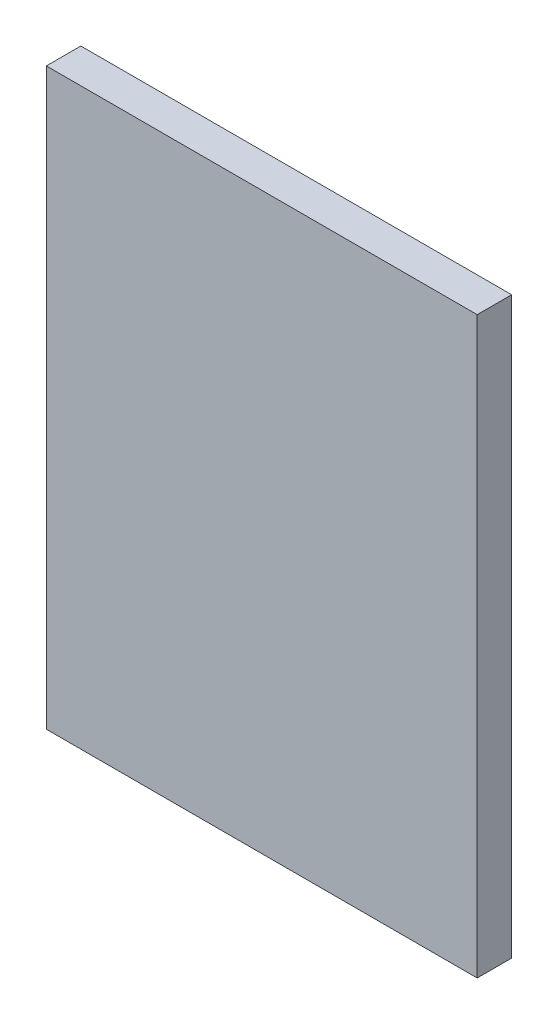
ISO-10303-21;
HEADER;
FILE_DESCRIPTION(('STEP AP214'),'2;1');
FILE_NAME('part.step','',(''),(''),'','','');
FILE_SCHEMA(('AUTOMOTIVE_DESIGN { 1 0 10303 214 1 1 1 1 }'));
ENDSEC;
DATA;
#1=APPLICATION_CONTEXT('core data for automotive mechanical design processes');
#2=APPLICATION_PROTOCOL_DEFINITION('international standard','automotive_design',2000,#1);
#3=PRODUCT_CONTEXT('',#1,'mechanical');
#4=PRODUCT('Part','Part','',(#3));
#5=PRODUCT_RELATED_PRODUCT_CATEGORY('part','',(#4));
#6=PRODUCT_DEFINITION_FORMATION('','',#4);
#7=PRODUCT_DEFINITION_CONTEXT('part definition',#1,'design');
#8=PRODUCT_DEFINITION('design','',#6,#7);
#9=PRODUCT_DEFINITION_SHAPE('','',#8);
#10=(LENGTH_UNIT() NAMED_UNIT(*) SI_UNIT(.MILLI.,.METRE.));
#11=(NAMED_UNIT(*) PLANE_ANGLE_UNIT() SI_UNIT($,.RADIAN.));
#12=(NAMED_UNIT(*) SI_UNIT($,.STERADIAN.) SOLID_ANGLE_UNIT());
#13=UNCERTAINTY_MEASURE_WITH_UNIT(LENGTH_MEASURE(1.E-05),#10,'distance_accuracy_value','');
#14=(GEOMETRIC_REPRESENTATION_CONTEXT(3) GLOBAL_UNCERTAINTY_ASSIGNED_CONTEXT((#13)) GLOBAL_UNIT_ASSIGNED_CONTEXT((#10,
#11,#12)) REPRESENTATION_CONTEXT('',''));
#15=CARTESIAN_POINT('',(0.,0.,0.));
#16=DIRECTION('',(0.,0.,1.));
#17=DIRECTION('',(1.,0.,0.));
#18=AXIS2_PLACEMENT_3D('',#15,#16,#17);
#19=CARTESIAN_POINT('',(0.,0.,12.));
#20=DIRECTION('',(0.,0.,1.));
#21=DIRECTION('',(1.,0.,0.));
#22=AXIS2_PLACEMENT_3D('',#19,#20,#21);
#23=PLANE('',#22);
#24=DIRECTION('',(1.,0.,0.));
#25=VECTOR('',#24,1.);
#26=CARTESIAN_POINT('',(-75.,-100.,12.));
#27=LINE('',#26,#25);
#28=CARTESIAN_POINT('',(-75.,-100.,12.));
#29=VERTEX_POINT('',#28);
#30=CARTESIAN_POINT('',(75.,-100.,12.));
#31=VERTEX_POINT('',#30);
#32=EDGE_CURVE('E81',#29,#31,#27,.T.);
#33=ORIENTED_EDGE('',*,*,#32,.T.);
#34=DIRECTION('',(0.,1.,0.));
#35=VECTOR('',#34,1.);
#36=CARTESIAN_POINT('',(75.,-100.,12.));
#37=LINE('',#36,#35);
#38=CARTESIAN_POINT('',(75.,100.,12.));
#39=VERTEX_POINT('',#38);
#40=EDGE_CURVE('E103',#31,#39,#37,.T.);
#41=ORIENTED_EDGE('',*,*,#40,.T.);
#42=DIRECTION('',(-1.,0.,0.));
#43=VECTOR('',#42,1.);
#44=CARTESIAN_POINT('',(75.,100.,12.));
#45=LINE('',#44,#43);
#46=CARTESIAN_POINT('',(-75.,100.,12.));
#47=VERTEX_POINT('',#46);
#48=EDGE_CURVE('E73',#39,#47,#45,.T.);
#49=ORIENTED_EDGE('',*,*,#48,.T.);
#50=DIRECTION('',(0.,-1.,0.));
#51=VECTOR('',#50,1.);
#52=CARTESIAN_POINT('',(-75.,100.,12.));
#53=LINE('',#52,#51);
#54=EDGE_CURVE('E10',#47,#29,#53,.T.);
#55=ORIENTED_EDGE('',*,*,#54,.T.);
#56=EDGE_LOOP('',(#33,#41,#49,#55));
#57=FACE_BOUND('',#56,.T.);
#58=ADVANCED_FACE('F16',(#57),#23,.T.);
#59=CARTESIAN_POINT('',(0.,0.,0.));
#60=DIRECTION('',(0.,0.,1.));
#61=DIRECTION('',(1.,0.,0.));
#62=AXIS2_PLACEMENT_3D('',#59,#60,#61);
#63=PLANE('',#62);
#64=DIRECTION('',(0.,-1.,0.));
#65=VECTOR('',#64,1.);
#66=CARTESIAN_POINT('',(-75.,100.,0.));
#67=LINE('',#66,#65);
#68=CARTESIAN_POINT('',(-75.,100.,0.));
#69=VERTEX_POINT('',#68);
#70=CARTESIAN_POINT('',(-75.,-100.,0.));
#71=VERTEX_POINT('',#70);
#72=EDGE_CURVE('E25',#69,#71,#67,.T.);
#73=ORIENTED_EDGE('',*,*,#72,.F.);
#74=DIRECTION('',(-1.,0.,0.));
#75=VECTOR('',#74,1.);
#76=CARTESIAN_POINT('',(75.,100.,0.));
#77=LINE('',#76,#75);
#78=CARTESIAN_POINT('',(75.,100.,0.));
#79=VERTEX_POINT('',#78);
#80=EDGE_CURVE('E109',#79,#69,#77,.T.);
#81=ORIENTED_EDGE('',*,*,#80,.F.);
#82=DIRECTION('',(0.,1.,0.));
#83=VECTOR('',#82,1.);
#84=CARTESIAN_POINT('',(75.,-100.,0.));
#85=LINE('',#84,#83);
#86=CARTESIAN_POINT('',(75.,-100.,0.));
#87=VERTEX_POINT('',#86);
#88=EDGE_CURVE('E83',#87,#79,#85,.T.);
#89=ORIENTED_EDGE('',*,*,#88,.F.);
#90=DIRECTION('',(1.,0.,0.));
#91=VECTOR('',#90,1.);
#92=CARTESIAN_POINT('',(-75.,-100.,0.));
#93=LINE('',#92,#91);
#94=EDGE_CURVE('E79',#71,#87,#93,.T.);
#95=ORIENTED_EDGE('',*,*,#94,.F.);
#96=EDGE_LOOP('',(#73,#81,#89,#95));
#97=FACE_BOUND('',#96,.T.);
#98=ADVANCED_FACE('F85',(#97),#63,.F.);
#99=CARTESIAN_POINT('',(-75.,100.,0.));
#100=DIRECTION('',(1.,0.,0.));
#101=DIRECTION('',(0.,1.,0.));
#102=AXIS2_PLACEMENT_3D('',#99,#100,#101);
#103=PLANE('',#102);
#104=ORIENTED_EDGE('',*,*,#72,.T.);
#105=DIRECTION('',(0.,0.,1.));
#106=VECTOR('',#105,1.);
#107=CARTESIAN_POINT('',(-75.,-100.,0.));
#108=LINE('',#107,#106);
#109=EDGE_CURVE('E68',#71,#29,#108,.T.);
#110=ORIENTED_EDGE('',*,*,#109,.T.);
#111=ORIENTED_EDGE('',*,*,#54,.F.);
#112=DIRECTION('',(0.,0.,1.));
#113=VECTOR('',#112,1.);
#114=CARTESIAN_POINT('',(-75.,100.,0.));
#115=LINE('',#114,#113);
#116=EDGE_CURVE('E19',#69,#47,#115,.T.);
#117=ORIENTED_EDGE('',*,*,#116,.F.);
#118=EDGE_LOOP('',(#104,#110,#111,#117));
#119=FACE_BOUND('',#118,.T.);
#120=ADVANCED_FACE('F67',(#119),#103,.F.);
#121=CARTESIAN_POINT('',(75.,100.,0.));
#122=DIRECTION('',(0.,-1.,0.));
#123=DIRECTION('',(0.,0.,-1.));
#124=AXIS2_PLACEMENT_3D('',#121,#122,#123);
#125=PLANE('',#124);
#126=ORIENTED_EDGE('',*,*,#80,.T.);
#127=ORIENTED_EDGE('',*,*,#116,.T.);
#128=ORIENTED_EDGE('',*,*,#48,.F.);
#129=DIRECTION('',(0.,0.,1.));
#130=VECTOR('',#129,1.);
#131=CARTESIAN_POINT('',(75.,100.,0.));
#132=LINE('',#131,#130);
#133=EDGE_CURVE('E99',#79,#39,#132,.T.);
#134=ORIENTED_EDGE('',*,*,#133,.F.);
#135=EDGE_LOOP('',(#126,#127,#128,#134));
#136=FACE_BOUND('',#135,.T.);
#137=ADVANCED_FACE('F117',(#136),#125,.F.);
#138=CARTESIAN_POINT('',(75.,-100.,0.));
#139=DIRECTION('',(-1.,0.,0.));
#140=DIRECTION('',(0.,0.,1.));
#141=AXIS2_PLACEMENT_3D('',#138,#139,#140);
#142=PLANE('',#141);
#143=ORIENTED_EDGE('',*,*,#88,.T.);
#144=ORIENTED_EDGE('',*,*,#133,.T.);
#145=ORIENTED_EDGE('',*,*,#40,.F.);
#146=DIRECTION('',(0.,0.,1.));
#147=VECTOR('',#146,1.);
#148=CARTESIAN_POINT('',(75.,-100.,0.));
#149=LINE('',#148,#147);
#150=EDGE_CURVE('E89',#87,#31,#149,.T.);
#151=ORIENTED_EDGE('',*,*,#150,.F.);
#152=EDGE_LOOP('',(#143,#144,#145,#151));
#153=FACE_BOUND('',#152,.T.);
#154=ADVANCED_FACE('F120',(#153),#142,.F.);
#155=CARTESIAN_POINT('',(-75.,-100.,0.));
#156=DIRECTION('',(0.,1.,0.));
#157=DIRECTION('',(1.,0.,0.));
#158=AXIS2_PLACEMENT_3D('',#155,#156,#157);
#159=PLANE('',#158);
#160=ORIENTED_EDGE('',*,*,#94,.T.);
#161=ORIENTED_EDGE('',*,*,#150,.T.);
#162=ORIENTED_EDGE('',*,*,#32,.F.);
#163=ORIENTED_EDGE('',*,*,#109,.F.);
#164=EDGE_LOOP('',(#160,#161,#162,#163));
#165=FACE_BOUND('',#164,.T.);
#166=ADVANCED_FACE('F77',(#165),#159,.F.);
#167=CLOSED_SHELL('',(#58,#98,#120,#137,#154,#166));
#168=MANIFOLD_SOLID_BREP('B1',#167);
#169=ADVANCED_BREP_SHAPE_REPRESENTATION('',(#18,#168),#14);
#170=SHAPE_DEFINITION_REPRESENTATION(#9,#169);
ENDSEC;
END-ISO-10303-21;
